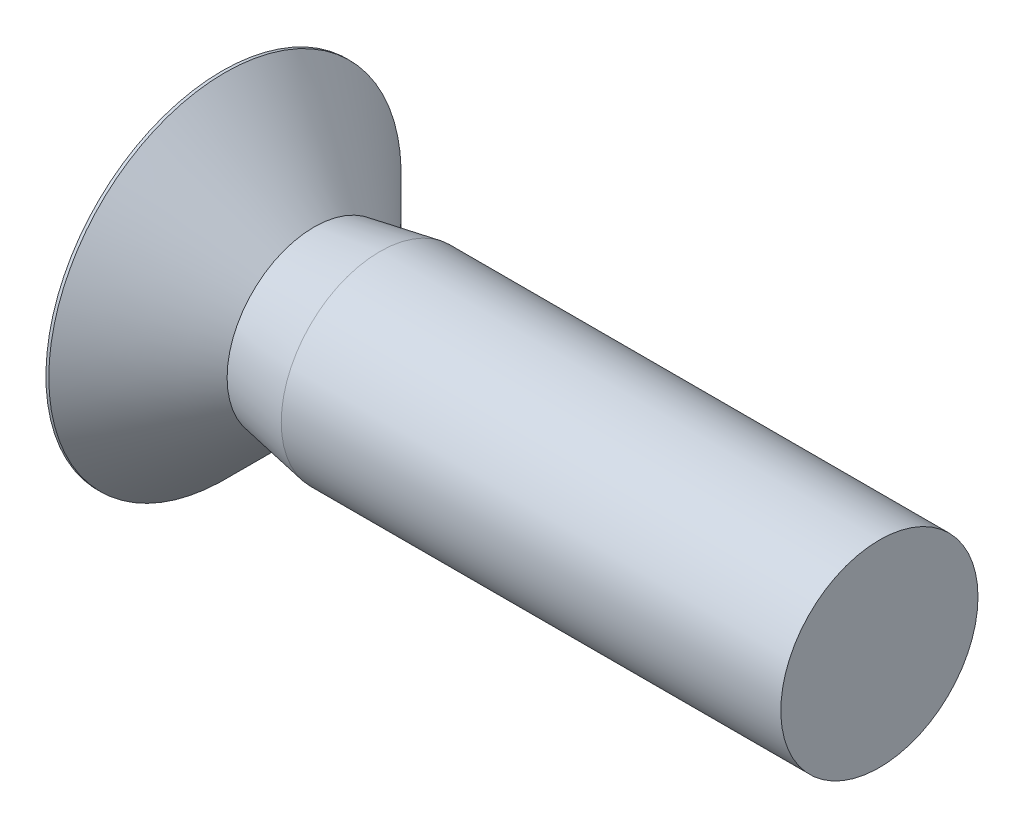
ISO-10303-21;
HEADER;
FILE_DESCRIPTION(('STEP AP214'),'2;1');
FILE_NAME('part.step','',(''),(''),'','','');
FILE_SCHEMA(('AUTOMOTIVE_DESIGN { 1 0 10303 214 1 1 1 1 }'));
ENDSEC;
DATA;
#1=APPLICATION_CONTEXT('core data for automotive mechanical design processes');
#2=APPLICATION_PROTOCOL_DEFINITION('international standard','automotive_design',2000,#1);
#3=PRODUCT_CONTEXT('',#1,'mechanical');
#4=PRODUCT('Part','Part','',(#3));
#5=PRODUCT_RELATED_PRODUCT_CATEGORY('part','',(#4));
#6=PRODUCT_DEFINITION_FORMATION('','',#4);
#7=PRODUCT_DEFINITION_CONTEXT('part definition',#1,'design');
#8=PRODUCT_DEFINITION('design','',#6,#7);
#9=PRODUCT_DEFINITION_SHAPE('','',#8);
#10=(LENGTH_UNIT() NAMED_UNIT(*) SI_UNIT(.MILLI.,.METRE.));
#11=(NAMED_UNIT(*) PLANE_ANGLE_UNIT() SI_UNIT($,.RADIAN.));
#12=(NAMED_UNIT(*) SI_UNIT($,.STERADIAN.) SOLID_ANGLE_UNIT());
#13=UNCERTAINTY_MEASURE_WITH_UNIT(LENGTH_MEASURE(1.E-05),#10,'distance_accuracy_value','');
#14=(GEOMETRIC_REPRESENTATION_CONTEXT(3) GLOBAL_UNCERTAINTY_ASSIGNED_CONTEXT((#13)) GLOBAL_UNIT_ASSIGNED_CONTEXT((#10,
#11,#12)) REPRESENTATION_CONTEXT('',''));
#15=CARTESIAN_POINT('',(0.,0.,0.));
#16=DIRECTION('',(0.,0.,1.));
#17=DIRECTION('',(1.,0.,0.));
#18=AXIS2_PLACEMENT_3D('',#15,#16,#17);
#19=CARTESIAN_POINT('',(1.4,0.,0.));
#20=DIRECTION('',(-1.,0.,0.));
#21=DIRECTION('',(0.,1.,0.));
#22=AXIS2_PLACEMENT_3D('',#19,#20,#21);
#23=CONICAL_SURFACE('',#22,1.32367301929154,0.78539816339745);
#24=CARTESIAN_POINT('',(0.0436730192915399,0.,0.));
#25=DIRECTION('',(-1.,0.,0.));
#26=DIRECTION('',(0.,0.,1.));
#27=AXIS2_PLACEMENT_3D('',#24,#25,#26);
#28=CIRCLE('',#27,2.68);
#29=CARTESIAN_POINT('',(0.0436730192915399,0.,2.68));
#30=VERTEX_POINT('',#29);
#31=EDGE_CURVE('E206',#30,#30,#28,.F.);
#32=ORIENTED_EDGE('',*,*,#31,.T.);
#33=EDGE_LOOP('',(#32));
#34=FACE_BOUND('',#33,.T.);
#35=CARTESIAN_POINT('',(1.4,0.,0.));
#36=DIRECTION('',(1.,0.,0.));
#37=DIRECTION('',(0.,1.,0.));
#38=AXIS2_PLACEMENT_3D('',#35,#36,#37);
#39=CIRCLE('',#38,1.32367301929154);
#40=CARTESIAN_POINT('',(1.4,1.32367301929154,0.));
#41=VERTEX_POINT('',#40);
#42=EDGE_CURVE('E219',#41,#41,#39,.T.);
#43=ORIENTED_EDGE('',*,*,#42,.F.);
#44=EDGE_LOOP('',(#43));
#45=FACE_BOUND('',#44,.T.);
#46=ADVANCED_FACE('F39',(#34,#45),#23,.T.);
#47=CARTESIAN_POINT('',(0.,-1.45,0.289999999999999));
#48=DIRECTION('',(-0.173648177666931,0.984807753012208,0.));
#49=DIRECTION('',(-0.984807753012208,-0.173648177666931,0.));
#50=AXIS2_PLACEMENT_3D('',#47,#48,#49);
#51=PLANE('',#50);
#52=DIRECTION('',(0.,0.,1.));
#53=VECTOR('',#52,1.);
#54=CARTESIAN_POINT('',(1.4,-1.20314222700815,0.29));
#55=LINE('',#54,#53);
#56=CARTESIAN_POINT('',(1.4,-1.20314222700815,-0.290000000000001));
#57=VERTEX_POINT('',#56);
#58=CARTESIAN_POINT('',(1.4,-1.20314222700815,0.29));
#59=VERTEX_POINT('',#58);
#60=EDGE_CURVE('E11',#57,#59,#55,.T.);
#61=ORIENTED_EDGE('',*,*,#60,.F.);
#62=DIRECTION('',(-0.984807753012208,-0.173648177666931,0.));
#63=VECTOR('',#62,1.);
#64=CARTESIAN_POINT('',(1.55615651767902,-1.17560761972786,-0.290000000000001));
#65=LINE('',#64,#63);
#66=CARTESIAN_POINT('',(0.,-1.45,-0.290000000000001));
#67=VERTEX_POINT('',#66);
#68=EDGE_CURVE('E266',#57,#67,#65,.T.);
#69=ORIENTED_EDGE('',*,*,#68,.T.);
#70=DIRECTION('',(0.,0.,-1.));
#71=VECTOR('',#70,1.);
#72=CARTESIAN_POINT('',(0.,-1.45,0.289999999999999));
#73=LINE('',#72,#71);
#74=CARTESIAN_POINT('',(0.,-1.45,0.289999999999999));
#75=VERTEX_POINT('',#74);
#76=EDGE_CURVE('E184',#75,#67,#73,.T.);
#77=ORIENTED_EDGE('',*,*,#76,.F.);
#78=DIRECTION('',(-0.984807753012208,-0.173648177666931,0.));
#79=VECTOR('',#78,1.);
#80=CARTESIAN_POINT('',(0.,-1.45,0.289999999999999));
#81=LINE('',#80,#79);
#82=EDGE_CURVE('E264',#59,#75,#81,.T.);
#83=ORIENTED_EDGE('',*,*,#82,.F.);
#84=EDGE_LOOP('',(#61,#69,#77,#83));
#85=FACE_BOUND('',#84,.T.);
#86=ADVANCED_FACE('F336',(#85),#51,.T.);
#87=CARTESIAN_POINT('',(1.4,0.29,0.29));
#88=DIRECTION('',(1.,0.,0.));
#89=DIRECTION('',(0.,0.,-1.));
#90=AXIS2_PLACEMENT_3D('',#87,#88,#89);
#91=PLANE('',#90);
#92=DIRECTION('',(0.,1.,0.));
#93=VECTOR('',#92,1.);
#94=CARTESIAN_POINT('',(1.4,-0.29,-0.29));
#95=LINE('',#94,#93);
#96=CARTESIAN_POINT('',(1.4,-0.49,-0.29));
#97=VERTEX_POINT('',#96);
#98=EDGE_CURVE('E315',#57,#97,#95,.T.);
#99=ORIENTED_EDGE('',*,*,#98,.F.);
#100=ORIENTED_EDGE('',*,*,#60,.T.);
#101=DIRECTION('',(0.,-1.,0.));
#102=VECTOR('',#101,1.);
#103=CARTESIAN_POINT('',(1.4,-0.29,0.29));
#104=LINE('',#103,#102);
#105=CARTESIAN_POINT('',(1.4,-0.49,0.29));
#106=VERTEX_POINT('',#105);
#107=EDGE_CURVE('E309',#106,#59,#104,.T.);
#108=ORIENTED_EDGE('',*,*,#107,.F.);
#109=CARTESIAN_POINT('',(1.4,-0.49,0.49));
#110=DIRECTION('',(1.,0.,0.));
#111=DIRECTION('',(0.,0.,-1.));
#112=AXIS2_PLACEMENT_3D('',#109,#110,#111);
#113=CIRCLE('',#112,0.2);
#114=CARTESIAN_POINT('',(1.4,-0.29,0.49));
#115=VERTEX_POINT('',#114);
#116=EDGE_CURVE('E252',#106,#115,#113,.T.);
#117=ORIENTED_EDGE('',*,*,#116,.T.);
#118=DIRECTION('',(0.,0.,-1.));
#119=VECTOR('',#118,1.);
#120=CARTESIAN_POINT('',(1.4,-0.29,1.45));
#121=LINE('',#120,#119);
#122=CARTESIAN_POINT('',(1.4,-0.29,1.20314222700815));
#123=VERTEX_POINT('',#122);
#124=EDGE_CURVE('E307',#123,#115,#121,.T.);
#125=ORIENTED_EDGE('',*,*,#124,.F.);
#126=DIRECTION('',(0.,1.,0.));
#127=VECTOR('',#126,1.);
#128=CARTESIAN_POINT('',(1.4,0.29,1.20314222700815));
#129=LINE('',#128,#127);
#130=CARTESIAN_POINT('',(1.4,0.29,1.20314222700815));
#131=VERTEX_POINT('',#130);
#132=EDGE_CURVE('E54',#123,#131,#129,.T.);
#133=ORIENTED_EDGE('',*,*,#132,.T.);
#134=DIRECTION('',(0.,0.,1.));
#135=VECTOR('',#134,1.);
#136=CARTESIAN_POINT('',(1.4,0.29,1.45));
#137=LINE('',#136,#135);
#138=CARTESIAN_POINT('',(1.4,0.29,0.49));
#139=VERTEX_POINT('',#138);
#140=EDGE_CURVE('E160',#139,#131,#137,.T.);
#141=ORIENTED_EDGE('',*,*,#140,.F.);
#142=CARTESIAN_POINT('',(1.4,0.49,0.49));
#143=DIRECTION('',(1.,0.,0.));
#144=DIRECTION('',(0.,0.,-1.));
#145=AXIS2_PLACEMENT_3D('',#142,#143,#144);
#146=CIRCLE('',#145,0.2);
#147=CARTESIAN_POINT('',(1.4,0.49,0.29));
#148=VERTEX_POINT('',#147);
#149=EDGE_CURVE('E258',#139,#148,#146,.T.);
#150=ORIENTED_EDGE('',*,*,#149,.T.);
#151=DIRECTION('',(0.,-1.,0.));
#152=VECTOR('',#151,1.);
#153=CARTESIAN_POINT('',(1.4,1.45,0.289999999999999));
#154=LINE('',#153,#152);
#155=CARTESIAN_POINT('',(1.4,1.20314222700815,0.29));
#156=VERTEX_POINT('',#155);
#157=EDGE_CURVE('E205',#156,#148,#154,.T.);
#158=ORIENTED_EDGE('',*,*,#157,.F.);
#159=DIRECTION('',(0.,0.,-1.));
#160=VECTOR('',#159,1.);
#161=CARTESIAN_POINT('',(1.4,1.20314222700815,0.29));
#162=LINE('',#161,#160);
#163=CARTESIAN_POINT('',(1.4,1.20314222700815,-0.29));
#164=VERTEX_POINT('',#163);
#165=EDGE_CURVE('E47',#156,#164,#162,.T.);
#166=ORIENTED_EDGE('',*,*,#165,.T.);
#167=DIRECTION('',(0.,1.,0.));
#168=VECTOR('',#167,1.);
#169=CARTESIAN_POINT('',(1.4,1.45,-0.29));
#170=LINE('',#169,#168);
#171=CARTESIAN_POINT('',(1.4,0.49,-0.29));
#172=VERTEX_POINT('',#171);
#173=EDGE_CURVE('E275',#172,#164,#170,.T.);
#174=ORIENTED_EDGE('',*,*,#173,.F.);
#175=CARTESIAN_POINT('',(1.4,0.49,-0.49));
#176=DIRECTION('',(1.,0.,0.));
#177=DIRECTION('',(0.,0.,-1.));
#178=AXIS2_PLACEMENT_3D('',#175,#176,#177);
#179=CIRCLE('',#178,0.2);
#180=CARTESIAN_POINT('',(1.4,0.29,-0.49));
#181=VERTEX_POINT('',#180);
#182=EDGE_CURVE('E261',#172,#181,#179,.T.);
#183=ORIENTED_EDGE('',*,*,#182,.T.);
#184=DIRECTION('',(0.,0.,1.));
#185=VECTOR('',#184,1.);
#186=CARTESIAN_POINT('',(1.4,0.29,-0.29));
#187=LINE('',#186,#185);
#188=CARTESIAN_POINT('',(1.4,0.29,-1.20314222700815));
#189=VERTEX_POINT('',#188);
#190=EDGE_CURVE('E296',#189,#181,#187,.T.);
#191=ORIENTED_EDGE('',*,*,#190,.F.);
#192=DIRECTION('',(0.,-1.,0.));
#193=VECTOR('',#192,1.);
#194=CARTESIAN_POINT('',(1.4,0.29,-1.20314222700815));
#195=LINE('',#194,#193);
#196=CARTESIAN_POINT('',(1.4,-0.29,-1.20314222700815));
#197=VERTEX_POINT('',#196);
#198=EDGE_CURVE('E280',#189,#197,#195,.T.);
#199=ORIENTED_EDGE('',*,*,#198,.T.);
#200=DIRECTION('',(0.,0.,-1.));
#201=VECTOR('',#200,1.);
#202=CARTESIAN_POINT('',(1.4,-0.29,-0.29));
#203=LINE('',#202,#201);
#204=CARTESIAN_POINT('',(1.4,-0.29,-0.49));
#205=VERTEX_POINT('',#204);
#206=EDGE_CURVE('E298',#205,#197,#203,.T.);
#207=ORIENTED_EDGE('',*,*,#206,.F.);
#208=CARTESIAN_POINT('',(1.4,-0.49,-0.490000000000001));
#209=DIRECTION('',(1.,0.,0.));
#210=DIRECTION('',(0.,0.,-1.));
#211=AXIS2_PLACEMENT_3D('',#208,#209,#210);
#212=CIRCLE('',#211,0.2);
#213=EDGE_CURVE('E255',#205,#97,#212,.T.);
#214=ORIENTED_EDGE('',*,*,#213,.T.);
#215=EDGE_LOOP('',(#99,#100,#108,#117,#125,#133,#141,#150,#158,#166,#174,#183,#191,#199,#207,#214));
#216=FACE_BOUND('',#215,.T.);
#217=ADVANCED_FACE('F285',(#216),#91,.F.);
#218=CARTESIAN_POINT('',(0.,1.45,0.289999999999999));
#219=DIRECTION('',(-0.173648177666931,-0.984807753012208,0.));
#220=DIRECTION('',(0.984807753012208,-0.173648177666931,0.));
#221=AXIS2_PLACEMENT_3D('',#218,#219,#220);
#222=PLANE('',#221);
#223=ORIENTED_EDGE('',*,*,#165,.F.);
#224=DIRECTION('',(-0.984807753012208,0.173648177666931,0.));
#225=VECTOR('',#224,1.);
#226=CARTESIAN_POINT('',(1.35778483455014,1.21058589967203,0.29));
#227=LINE('',#226,#225);
#228=CARTESIAN_POINT('',(0.,1.45,0.289999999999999));
#229=VERTEX_POINT('',#228);
#230=EDGE_CURVE('E272',#156,#229,#227,.T.);
#231=ORIENTED_EDGE('',*,*,#230,.T.);
#232=DIRECTION('',(0.,0.,1.));
#233=VECTOR('',#232,1.);
#234=CARTESIAN_POINT('',(0.,1.45,0.289999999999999));
#235=LINE('',#234,#233);
#236=CARTESIAN_POINT('',(0.,1.45,-0.29));
#237=VERTEX_POINT('',#236);
#238=EDGE_CURVE('E202',#237,#229,#235,.T.);
#239=ORIENTED_EDGE('',*,*,#238,.F.);
#240=DIRECTION('',(-0.984807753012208,0.173648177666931,0.));
#241=VECTOR('',#240,1.);
#242=CARTESIAN_POINT('',(0.,1.45,-0.29));
#243=LINE('',#242,#241);
#244=EDGE_CURVE('E269',#164,#237,#243,.T.);
#245=ORIENTED_EDGE('',*,*,#244,.F.);
#246=EDGE_LOOP('',(#223,#231,#239,#245));
#247=FACE_BOUND('',#246,.T.);
#248=ADVANCED_FACE('F291',(#247),#222,.T.);
#249=CARTESIAN_POINT('',(0.,0.29,-1.45));
#250=DIRECTION('',(-0.173648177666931,0.,0.984807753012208));
#251=DIRECTION('',(0.984807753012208,0.,0.173648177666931));
#252=AXIS2_PLACEMENT_3D('',#249,#250,#251);
#253=PLANE('',#252);
#254=ORIENTED_EDGE('',*,*,#198,.F.);
#255=DIRECTION('',(-0.984807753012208,0.,-0.173648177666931));
#256=VECTOR('',#255,1.);
#257=CARTESIAN_POINT('',(1.55615651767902,0.29,-1.17560761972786));
#258=LINE('',#257,#256);
#259=CARTESIAN_POINT('',(0.,0.29,-1.45));
#260=VERTEX_POINT('',#259);
#261=EDGE_CURVE('E271',#189,#260,#258,.T.);
#262=ORIENTED_EDGE('',*,*,#261,.T.);
#263=DIRECTION('',(0.,1.,0.));
#264=VECTOR('',#263,1.);
#265=CARTESIAN_POINT('',(0.,0.29,-1.45));
#266=LINE('',#265,#264);
#267=CARTESIAN_POINT('',(0.,-0.29,-1.45));
#268=VERTEX_POINT('',#267);
#269=EDGE_CURVE('E193',#268,#260,#266,.T.);
#270=ORIENTED_EDGE('',*,*,#269,.F.);
#271=DIRECTION('',(-0.984807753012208,0.,-0.173648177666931));
#272=VECTOR('',#271,1.);
#273=CARTESIAN_POINT('',(0.,-0.29,-1.45));
#274=LINE('',#273,#272);
#275=EDGE_CURVE('E268',#197,#268,#274,.T.);
#276=ORIENTED_EDGE('',*,*,#275,.F.);
#277=EDGE_LOOP('',(#254,#262,#270,#276));
#278=FACE_BOUND('',#277,.T.);
#279=ADVANCED_FACE('F378',(#278),#253,.T.);
#280=CARTESIAN_POINT('',(0.,0.29,1.45));
#281=DIRECTION('',(-0.173648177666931,0.,-0.984807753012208));
#282=DIRECTION('',(-0.984807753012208,0.,0.173648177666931));
#283=AXIS2_PLACEMENT_3D('',#280,#281,#282);
#284=PLANE('',#283);
#285=ORIENTED_EDGE('',*,*,#132,.F.);
#286=DIRECTION('',(-0.984807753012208,0.,0.173648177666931));
#287=VECTOR('',#286,1.);
#288=CARTESIAN_POINT('',(1.35778483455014,-0.29,1.21058589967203));
#289=LINE('',#288,#287);
#290=CARTESIAN_POINT('',(0.,-0.29,1.45));
#291=VERTEX_POINT('',#290);
#292=EDGE_CURVE('E163',#123,#291,#289,.T.);
#293=ORIENTED_EDGE('',*,*,#292,.T.);
#294=DIRECTION('',(0.,-1.,0.));
#295=VECTOR('',#294,1.);
#296=CARTESIAN_POINT('',(0.,0.29,1.45));
#297=LINE('',#296,#295);
#298=CARTESIAN_POINT('',(0.,0.29,1.45));
#299=VERTEX_POINT('',#298);
#300=EDGE_CURVE('E169',#299,#291,#297,.T.);
#301=ORIENTED_EDGE('',*,*,#300,.F.);
#302=DIRECTION('',(-0.984807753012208,0.,0.173648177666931));
#303=VECTOR('',#302,1.);
#304=CARTESIAN_POINT('',(0.,0.29,1.45));
#305=LINE('',#304,#303);
#306=EDGE_CURVE('E155',#131,#299,#305,.T.);
#307=ORIENTED_EDGE('',*,*,#306,.F.);
#308=EDGE_LOOP('',(#285,#293,#301,#307));
#309=FACE_BOUND('',#308,.T.);
#310=ADVANCED_FACE('F41',(#309),#284,.T.);
#311=CARTESIAN_POINT('',(0.,0.,0.));
#312=DIRECTION('',(1.,0.,0.));
#313=DIRECTION('',(0.,0.,-1.));
#314=AXIS2_PLACEMENT_3D('',#311,#312,#313);
#315=PLANE('',#314);
#316=CARTESIAN_POINT('',(0.,0.,0.));
#317=DIRECTION('',(1.,0.,0.));
#318=DIRECTION('',(0.,0.,-1.));
#319=AXIS2_PLACEMENT_3D('',#316,#317,#318);
#320=CIRCLE('',#319,2.68);
#321=CARTESIAN_POINT('',(0.,0.,-2.68));
#322=VERTEX_POINT('',#321);
#323=EDGE_CURVE('E162',#322,#322,#320,.F.);
#324=ORIENTED_EDGE('',*,*,#323,.T.);
#325=EDGE_LOOP('',(#324));
#326=FACE_BOUND('',#325,.T.);
#327=DIRECTION('',(0.,0.,-1.));
#328=VECTOR('',#327,1.);
#329=CARTESIAN_POINT('',(0.,-0.29,1.45));
#330=LINE('',#329,#328);
#331=CARTESIAN_POINT('',(0.,-0.29,0.49));
#332=VERTEX_POINT('',#331);
#333=EDGE_CURVE('E176',#291,#332,#330,.T.);
#334=ORIENTED_EDGE('',*,*,#333,.T.);
#335=CARTESIAN_POINT('',(0.,-0.49,0.49));
#336=DIRECTION('',(1.,0.,0.));
#337=DIRECTION('',(0.,0.,-1.));
#338=AXIS2_PLACEMENT_3D('',#335,#336,#337);
#339=CIRCLE('',#338,0.2);
#340=CARTESIAN_POINT('',(0.,-0.49,0.29));
#341=VERTEX_POINT('',#340);
#342=EDGE_CURVE('E233',#332,#341,#339,.F.);
#343=ORIENTED_EDGE('',*,*,#342,.T.);
#344=DIRECTION('',(0.,-1.,0.));
#345=VECTOR('',#344,1.);
#346=CARTESIAN_POINT('',(0.,-0.29,0.29));
#347=LINE('',#346,#345);
#348=EDGE_CURVE('E178',#341,#75,#347,.T.);
#349=ORIENTED_EDGE('',*,*,#348,.T.);
#350=ORIENTED_EDGE('',*,*,#76,.T.);
#351=DIRECTION('',(0.,1.,0.));
#352=VECTOR('',#351,1.);
#353=CARTESIAN_POINT('',(0.,-0.29,-0.29));
#354=LINE('',#353,#352);
#355=CARTESIAN_POINT('',(0.,-0.49,-0.29));
#356=VERTEX_POINT('',#355);
#357=EDGE_CURVE('E187',#67,#356,#354,.T.);
#358=ORIENTED_EDGE('',*,*,#357,.T.);
#359=CARTESIAN_POINT('',(0.,-0.49,-0.490000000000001));
#360=DIRECTION('',(1.,0.,0.));
#361=DIRECTION('',(0.,0.,-1.));
#362=AXIS2_PLACEMENT_3D('',#359,#360,#361);
#363=CIRCLE('',#362,0.2);
#364=CARTESIAN_POINT('',(0.,-0.29,-0.49));
#365=VERTEX_POINT('',#364);
#366=EDGE_CURVE('E231',#356,#365,#363,.F.);
#367=ORIENTED_EDGE('',*,*,#366,.T.);
#368=DIRECTION('',(0.,0.,-1.));
#369=VECTOR('',#368,1.);
#370=CARTESIAN_POINT('',(0.,-0.29,-0.29));
#371=LINE('',#370,#369);
#372=EDGE_CURVE('E190',#365,#268,#371,.T.);
#373=ORIENTED_EDGE('',*,*,#372,.T.);
#374=ORIENTED_EDGE('',*,*,#269,.T.);
#375=DIRECTION('',(0.,0.,1.));
#376=VECTOR('',#375,1.);
#377=CARTESIAN_POINT('',(0.,0.29,-0.29));
#378=LINE('',#377,#376);
#379=CARTESIAN_POINT('',(0.,0.29,-0.49));
#380=VERTEX_POINT('',#379);
#381=EDGE_CURVE('E196',#260,#380,#378,.T.);
#382=ORIENTED_EDGE('',*,*,#381,.T.);
#383=CARTESIAN_POINT('',(0.,0.49,-0.49));
#384=DIRECTION('',(1.,0.,0.));
#385=DIRECTION('',(0.,0.,-1.));
#386=AXIS2_PLACEMENT_3D('',#383,#384,#385);
#387=CIRCLE('',#386,0.2);
#388=CARTESIAN_POINT('',(0.,0.49,-0.29));
#389=VERTEX_POINT('',#388);
#390=EDGE_CURVE('E228',#380,#389,#387,.F.);
#391=ORIENTED_EDGE('',*,*,#390,.T.);
#392=DIRECTION('',(0.,1.,0.));
#393=VECTOR('',#392,1.);
#394=CARTESIAN_POINT('',(0.,1.45,-0.29));
#395=LINE('',#394,#393);
#396=EDGE_CURVE('E199',#389,#237,#395,.T.);
#397=ORIENTED_EDGE('',*,*,#396,.T.);
#398=ORIENTED_EDGE('',*,*,#238,.T.);
#399=DIRECTION('',(0.,-1.,0.));
#400=VECTOR('',#399,1.);
#401=CARTESIAN_POINT('',(0.,1.45,0.289999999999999));
#402=LINE('',#401,#400);
#403=CARTESIAN_POINT('',(0.,0.49,0.29));
#404=VERTEX_POINT('',#403);
#405=EDGE_CURVE('E172',#229,#404,#402,.T.);
#406=ORIENTED_EDGE('',*,*,#405,.T.);
#407=CARTESIAN_POINT('',(0.,0.49,0.49));
#408=DIRECTION('',(1.,0.,0.));
#409=DIRECTION('',(0.,0.,-1.));
#410=AXIS2_PLACEMENT_3D('',#407,#408,#409);
#411=CIRCLE('',#410,0.2);
#412=CARTESIAN_POINT('',(0.,0.29,0.49));
#413=VERTEX_POINT('',#412);
#414=EDGE_CURVE('E171',#404,#413,#411,.F.);
#415=ORIENTED_EDGE('',*,*,#414,.T.);
#416=DIRECTION('',(0.,0.,1.));
#417=VECTOR('',#416,1.);
#418=CARTESIAN_POINT('',(0.,0.29,1.45));
#419=LINE('',#418,#417);
#420=EDGE_CURVE('E158',#413,#299,#419,.T.);
#421=ORIENTED_EDGE('',*,*,#420,.T.);
#422=ORIENTED_EDGE('',*,*,#300,.T.);
#423=EDGE_LOOP('',(#334,#343,#349,#350,#358,#367,#373,#374,#382,#391,#397,#398,#406,#415,#421,#422));
#424=FACE_BOUND('',#423,.T.);
#425=ADVANCED_FACE('F168',(#326,#424),#315,.F.);
#426=CARTESIAN_POINT('',(2.4,0.,0.));
#427=DIRECTION('',(1.,0.,0.));
#428=DIRECTION('',(0.,1.,0.));
#429=AXIS2_PLACEMENT_3D('',#426,#427,#428);
#430=CONICAL_SURFACE('',#429,1.5,0.174532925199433);
#431=ORIENTED_EDGE('',*,*,#42,.T.);
#432=EDGE_LOOP('',(#431));
#433=FACE_BOUND('',#432,.T.);
#434=CARTESIAN_POINT('',(2.4,0.,0.));
#435=DIRECTION('',(1.,0.,0.));
#436=DIRECTION('',(0.,0.,-1.));
#437=AXIS2_PLACEMENT_3D('',#434,#435,#436);
#438=CIRCLE('',#437,1.5);
#439=CARTESIAN_POINT('',(2.4,1.5,0.));
#440=VERTEX_POINT('',#439);
#441=CARTESIAN_POINT('',(2.4,-1.5,0.));
#442=VERTEX_POINT('',#441);
#443=EDGE_CURVE('E216',#440,#442,#438,.T.);
#444=ORIENTED_EDGE('',*,*,#443,.F.);
#445=CARTESIAN_POINT('',(2.4,0.,0.));
#446=DIRECTION('',(1.,0.,0.));
#447=DIRECTION('',(0.,1.,0.));
#448=AXIS2_PLACEMENT_3D('',#445,#446,#447);
#449=CIRCLE('',#448,1.5);
#450=EDGE_CURVE('E212',#442,#440,#449,.T.);
#451=ORIENTED_EDGE('',*,*,#450,.F.);
#452=EDGE_LOOP('',(#444,#451));
#453=FACE_BOUND('',#452,.T.);
#454=ADVANCED_FACE('F365',(#433,#453),#430,.T.);
#455=CARTESIAN_POINT('',(10.,0.,0.));
#456=DIRECTION('',(-1.,0.,0.));
#457=DIRECTION('',(0.,0.,1.));
#458=AXIS2_PLACEMENT_3D('',#455,#456,#457);
#459=CYLINDRICAL_SURFACE('',#458,1.5);
#460=ORIENTED_EDGE('',*,*,#450,.T.);
#461=ORIENTED_EDGE('',*,*,#443,.T.);
#462=EDGE_LOOP('',(#460,#461));
#463=FACE_BOUND('',#462,.T.);
#464=CARTESIAN_POINT('',(10.,0.,0.));
#465=DIRECTION('',(1.,0.,0.));
#466=DIRECTION('',(0.,0.,-1.));
#467=AXIS2_PLACEMENT_3D('',#464,#465,#466);
#468=CIRCLE('',#467,1.5);
#469=CARTESIAN_POINT('',(10.,0.,-1.5));
#470=VERTEX_POINT('',#469);
#471=EDGE_CURVE('E209',#470,#470,#468,.T.);
#472=ORIENTED_EDGE('',*,*,#471,.F.);
#473=EDGE_LOOP('',(#472));
#474=FACE_BOUND('',#473,.T.);
#475=ADVANCED_FACE('F429',(#463,#474),#459,.T.);
#476=CARTESIAN_POINT('',(10.,0.,0.));
#477=DIRECTION('',(1.,0.,0.));
#478=DIRECTION('',(0.,0.,-1.));
#479=AXIS2_PLACEMENT_3D('',#476,#477,#478);
#480=PLANE('',#479);
#481=ORIENTED_EDGE('',*,*,#471,.T.);
#482=EDGE_LOOP('',(#481));
#483=FACE_BOUND('',#482,.T.);
#484=ADVANCED_FACE('F546',(#483),#480,.T.);
#485=CARTESIAN_POINT('',(10.,0.,0.));
#486=DIRECTION('',(1.,0.,0.));
#487=DIRECTION('',(0.,1.,0.));
#488=AXIS2_PLACEMENT_3D('',#485,#486,#487);
#489=CYLINDRICAL_SURFACE('',#488,2.68);
#490=ORIENTED_EDGE('',*,*,#323,.F.);
#491=EDGE_LOOP('',(#490));
#492=FACE_BOUND('',#491,.T.);
#493=ORIENTED_EDGE('',*,*,#31,.F.);
#494=EDGE_LOOP('',(#493));
#495=FACE_BOUND('',#494,.T.);
#496=ADVANCED_FACE('F441',(#492,#495),#489,.T.);
#497=CARTESIAN_POINT('',(1.4,1.45,0.289999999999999));
#498=DIRECTION('',(0.,0.,-1.));
#499=DIRECTION('',(0.,1.,0.));
#500=AXIS2_PLACEMENT_3D('',#497,#498,#499);
#501=PLANE('',#500);
#502=ORIENTED_EDGE('',*,*,#230,.F.);
#503=ORIENTED_EDGE('',*,*,#157,.T.);
#504=DIRECTION('',(-1.,0.,0.));
#505=VECTOR('',#504,1.);
#506=CARTESIAN_POINT('',(1.4,0.49,0.29));
#507=LINE('',#506,#505);
#508=EDGE_CURVE('E242',#148,#404,#507,.T.);
#509=ORIENTED_EDGE('',*,*,#508,.T.);
#510=ORIENTED_EDGE('',*,*,#405,.F.);
#511=EDGE_LOOP('',(#502,#503,#509,#510));
#512=FACE_BOUND('',#511,.T.);
#513=ADVANCED_FACE('F302',(#512),#501,.T.);
#514=CARTESIAN_POINT('',(1.4,0.29,1.45));
#515=DIRECTION('',(0.,-1.,0.));
#516=DIRECTION('',(0.,0.,-1.));
#517=AXIS2_PLACEMENT_3D('',#514,#515,#516);
#518=PLANE('',#517);
#519=ORIENTED_EDGE('',*,*,#420,.F.);
#520=DIRECTION('',(-1.,0.,0.));
#521=VECTOR('',#520,1.);
#522=CARTESIAN_POINT('',(1.4,0.29,0.49));
#523=LINE('',#522,#521);
#524=EDGE_CURVE('E245',#413,#139,#523,.F.);
#525=ORIENTED_EDGE('',*,*,#524,.T.);
#526=ORIENTED_EDGE('',*,*,#140,.T.);
#527=ORIENTED_EDGE('',*,*,#306,.T.);
#528=EDGE_LOOP('',(#519,#525,#526,#527));
#529=FACE_BOUND('',#528,.T.);
#530=ADVANCED_FACE('F157',(#529),#518,.T.);
#531=CARTESIAN_POINT('',(1.4,-0.29,1.45));
#532=DIRECTION('',(0.,1.,0.));
#533=DIRECTION('',(0.,0.,1.));
#534=AXIS2_PLACEMENT_3D('',#531,#532,#533);
#535=PLANE('',#534);
#536=ORIENTED_EDGE('',*,*,#292,.F.);
#537=ORIENTED_EDGE('',*,*,#124,.T.);
#538=DIRECTION('',(-1.,0.,0.));
#539=VECTOR('',#538,1.);
#540=CARTESIAN_POINT('',(1.4,-0.29,0.49));
#541=LINE('',#540,#539);
#542=EDGE_CURVE('E223',#115,#332,#541,.T.);
#543=ORIENTED_EDGE('',*,*,#542,.T.);
#544=ORIENTED_EDGE('',*,*,#333,.F.);
#545=EDGE_LOOP('',(#536,#537,#543,#544));
#546=FACE_BOUND('',#545,.T.);
#547=ADVANCED_FACE('F345',(#546),#535,.T.);
#548=CARTESIAN_POINT('',(1.4,-0.29,0.29));
#549=DIRECTION('',(0.,0.,-1.));
#550=DIRECTION('',(0.,1.,0.));
#551=AXIS2_PLACEMENT_3D('',#548,#549,#550);
#552=PLANE('',#551);
#553=ORIENTED_EDGE('',*,*,#348,.F.);
#554=DIRECTION('',(-1.,0.,0.));
#555=VECTOR('',#554,1.);
#556=CARTESIAN_POINT('',(1.4,-0.49,0.29));
#557=LINE('',#556,#555);
#558=EDGE_CURVE('E235',#341,#106,#557,.F.);
#559=ORIENTED_EDGE('',*,*,#558,.T.);
#560=ORIENTED_EDGE('',*,*,#107,.T.);
#561=ORIENTED_EDGE('',*,*,#82,.T.);
#562=EDGE_LOOP('',(#553,#559,#560,#561));
#563=FACE_BOUND('',#562,.T.);
#564=ADVANCED_FACE('F346',(#563),#552,.T.);
#565=CARTESIAN_POINT('',(1.4,-0.29,-0.29));
#566=DIRECTION('',(0.,0.,1.));
#567=DIRECTION('',(0.,-1.,0.));
#568=AXIS2_PLACEMENT_3D('',#565,#566,#567);
#569=PLANE('',#568);
#570=ORIENTED_EDGE('',*,*,#68,.F.);
#571=ORIENTED_EDGE('',*,*,#98,.T.);
#572=DIRECTION('',(-1.,0.,0.));
#573=VECTOR('',#572,1.);
#574=CARTESIAN_POINT('',(1.4,-0.49,-0.29));
#575=LINE('',#574,#573);
#576=EDGE_CURVE('E237',#97,#356,#575,.T.);
#577=ORIENTED_EDGE('',*,*,#576,.T.);
#578=ORIENTED_EDGE('',*,*,#357,.F.);
#579=EDGE_LOOP('',(#570,#571,#577,#578));
#580=FACE_BOUND('',#579,.T.);
#581=ADVANCED_FACE('F331',(#580),#569,.T.);
#582=CARTESIAN_POINT('',(1.4,-0.29,-0.29));
#583=DIRECTION('',(0.,1.,0.));
#584=DIRECTION('',(0.,0.,1.));
#585=AXIS2_PLACEMENT_3D('',#582,#583,#584);
#586=PLANE('',#585);
#587=ORIENTED_EDGE('',*,*,#372,.F.);
#588=DIRECTION('',(-1.,0.,0.));
#589=VECTOR('',#588,1.);
#590=CARTESIAN_POINT('',(1.4,-0.29,-0.49));
#591=LINE('',#590,#589);
#592=EDGE_CURVE('E240',#365,#205,#591,.F.);
#593=ORIENTED_EDGE('',*,*,#592,.T.);
#594=ORIENTED_EDGE('',*,*,#206,.T.);
#595=ORIENTED_EDGE('',*,*,#275,.T.);
#596=EDGE_LOOP('',(#587,#593,#594,#595));
#597=FACE_BOUND('',#596,.T.);
#598=ADVANCED_FACE('F320',(#597),#586,.T.);
#599=CARTESIAN_POINT('',(1.4,0.29,-0.29));
#600=DIRECTION('',(0.,-1.,0.));
#601=DIRECTION('',(0.,0.,-1.));
#602=AXIS2_PLACEMENT_3D('',#599,#600,#601);
#603=PLANE('',#602);
#604=ORIENTED_EDGE('',*,*,#261,.F.);
#605=ORIENTED_EDGE('',*,*,#190,.T.);
#606=DIRECTION('',(-1.,0.,0.));
#607=VECTOR('',#606,1.);
#608=CARTESIAN_POINT('',(1.4,0.29,-0.49));
#609=LINE('',#608,#607);
#610=EDGE_CURVE('E247',#181,#380,#609,.T.);
#611=ORIENTED_EDGE('',*,*,#610,.T.);
#612=ORIENTED_EDGE('',*,*,#381,.F.);
#613=EDGE_LOOP('',(#604,#605,#611,#612));
#614=FACE_BOUND('',#613,.T.);
#615=ADVANCED_FACE('F389',(#614),#603,.T.);
#616=CARTESIAN_POINT('',(1.4,1.45,-0.29));
#617=DIRECTION('',(0.,0.,1.));
#618=DIRECTION('',(0.,-1.,0.));
#619=AXIS2_PLACEMENT_3D('',#616,#617,#618);
#620=PLANE('',#619);
#621=ORIENTED_EDGE('',*,*,#396,.F.);
#622=DIRECTION('',(-1.,0.,0.));
#623=VECTOR('',#622,1.);
#624=CARTESIAN_POINT('',(1.4,0.49,-0.29));
#625=LINE('',#624,#623);
#626=EDGE_CURVE('E250',#389,#172,#625,.F.);
#627=ORIENTED_EDGE('',*,*,#626,.T.);
#628=ORIENTED_EDGE('',*,*,#173,.T.);
#629=ORIENTED_EDGE('',*,*,#244,.T.);
#630=EDGE_LOOP('',(#621,#627,#628,#629));
#631=FACE_BOUND('',#630,.T.);
#632=ADVANCED_FACE('F294',(#631),#620,.T.);
#633=CARTESIAN_POINT('',(1.4,-0.49,0.49));
#634=DIRECTION('',(-1.,0.,0.));
#635=DIRECTION('',(0.,0.,1.));
#636=AXIS2_PLACEMENT_3D('',#633,#634,#635);
#637=CYLINDRICAL_SURFACE('',#636,0.2);
#638=ORIENTED_EDGE('',*,*,#116,.F.);
#639=ORIENTED_EDGE('',*,*,#558,.F.);
#640=ORIENTED_EDGE('',*,*,#342,.F.);
#641=ORIENTED_EDGE('',*,*,#542,.F.);
#642=EDGE_LOOP('',(#638,#639,#640,#641));
#643=FACE_BOUND('',#642,.T.);
#644=ADVANCED_FACE('F343',(#643),#637,.T.);
#645=CARTESIAN_POINT('',(1.4,-0.49,-0.490000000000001));
#646=DIRECTION('',(-1.,0.,0.));
#647=DIRECTION('',(0.,0.,1.));
#648=AXIS2_PLACEMENT_3D('',#645,#646,#647);
#649=CYLINDRICAL_SURFACE('',#648,0.2);
#650=ORIENTED_EDGE('',*,*,#213,.F.);
#651=ORIENTED_EDGE('',*,*,#592,.F.);
#652=ORIENTED_EDGE('',*,*,#366,.F.);
#653=ORIENTED_EDGE('',*,*,#576,.F.);
#654=EDGE_LOOP('',(#650,#651,#652,#653));
#655=FACE_BOUND('',#654,.T.);
#656=ADVANCED_FACE('F327',(#655),#649,.T.);
#657=CARTESIAN_POINT('',(1.4,0.49,0.49));
#658=DIRECTION('',(-1.,0.,0.));
#659=DIRECTION('',(0.,0.,1.));
#660=AXIS2_PLACEMENT_3D('',#657,#658,#659);
#661=CYLINDRICAL_SURFACE('',#660,0.2);
#662=ORIENTED_EDGE('',*,*,#149,.F.);
#663=ORIENTED_EDGE('',*,*,#524,.F.);
#664=ORIENTED_EDGE('',*,*,#414,.F.);
#665=ORIENTED_EDGE('',*,*,#508,.F.);
#666=EDGE_LOOP('',(#662,#663,#664,#665));
#667=FACE_BOUND('',#666,.T.);
#668=ADVANCED_FACE('F306',(#667),#661,.T.);
#669=CARTESIAN_POINT('',(1.4,0.49,-0.49));
#670=DIRECTION('',(-1.,0.,0.));
#671=DIRECTION('',(0.,0.,1.));
#672=AXIS2_PLACEMENT_3D('',#669,#670,#671);
#673=CYLINDRICAL_SURFACE('',#672,0.2);
#674=ORIENTED_EDGE('',*,*,#182,.F.);
#675=ORIENTED_EDGE('',*,*,#626,.F.);
#676=ORIENTED_EDGE('',*,*,#390,.F.);
#677=ORIENTED_EDGE('',*,*,#610,.F.);
#678=EDGE_LOOP('',(#674,#675,#676,#677));
#679=FACE_BOUND('',#678,.T.);
#680=ADVANCED_FACE('F373',(#679),#673,.T.);
#681=CLOSED_SHELL('',(#46,#86,#217,#248,#279,#310,#425,#454,#475,#484,#496,#513,#530,#547,#564,
#581,#598,#615,#632,#644,#656,#668,#680));
#682=MANIFOLD_SOLID_BREP('B2',#681);
#683=ADVANCED_BREP_SHAPE_REPRESENTATION('',(#18,#682),#14);
#684=SHAPE_DEFINITION_REPRESENTATION(#9,#683);
ENDSEC;
END-ISO-10303-21;
